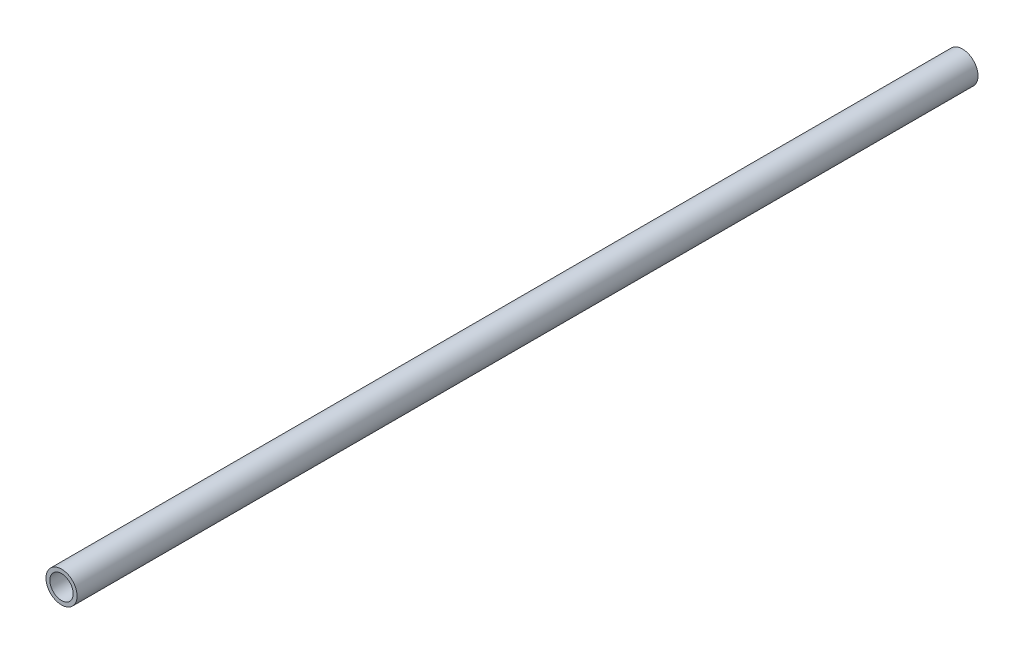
from build123d import *

# Parameters (mm, degrees)
ESQUISSE1_R        = 10
ESQUISSE1_R_2      = 7.5
BOSS_EXTRU_1_DEPTH = 579


with BuildPart() as part:
    # Esquisse1 → Boss.-Extru.1 (new body)
    with BuildSketch(Plane.XY):
        Circle(ESQUISSE1_R)
        Circle(ESQUISSE1_R_2, mode=Mode.SUBTRACT)
    extrude(amount=BOSS_EXTRU_1_DEPTH)


solid = part.part
